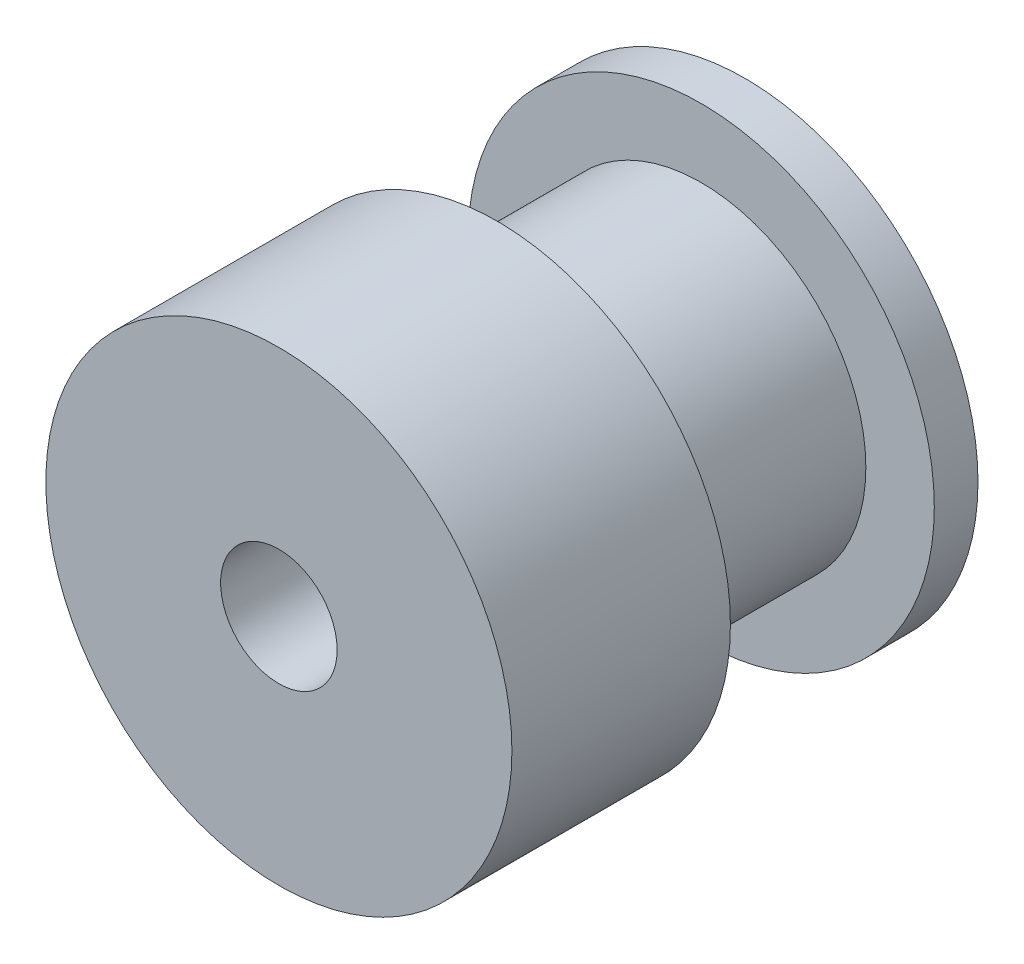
ISO-10303-21;
HEADER;
FILE_DESCRIPTION(('STEP AP214'),'2;1');
FILE_NAME('part.step','',(''),(''),'','','');
FILE_SCHEMA(('AUTOMOTIVE_DESIGN { 1 0 10303 214 1 1 1 1 }'));
ENDSEC;
DATA;
#1=APPLICATION_CONTEXT('core data for automotive mechanical design processes');
#2=APPLICATION_PROTOCOL_DEFINITION('international standard','automotive_design',2000,#1);
#3=PRODUCT_CONTEXT('',#1,'mechanical');
#4=PRODUCT('Part','Part','',(#3));
#5=PRODUCT_RELATED_PRODUCT_CATEGORY('part','',(#4));
#6=PRODUCT_DEFINITION_FORMATION('','',#4);
#7=PRODUCT_DEFINITION_CONTEXT('part definition',#1,'design');
#8=PRODUCT_DEFINITION('design','',#6,#7);
#9=PRODUCT_DEFINITION_SHAPE('','',#8);
#10=(LENGTH_UNIT() NAMED_UNIT(*) SI_UNIT(.MILLI.,.METRE.));
#11=(NAMED_UNIT(*) PLANE_ANGLE_UNIT() SI_UNIT($,.RADIAN.));
#12=(NAMED_UNIT(*) SI_UNIT($,.STERADIAN.) SOLID_ANGLE_UNIT());
#13=UNCERTAINTY_MEASURE_WITH_UNIT(LENGTH_MEASURE(1.E-05),#10,'distance_accuracy_value','');
#14=(GEOMETRIC_REPRESENTATION_CONTEXT(3) GLOBAL_UNCERTAINTY_ASSIGNED_CONTEXT((#13)) GLOBAL_UNIT_ASSIGNED_CONTEXT((#10,
#11,#12)) REPRESENTATION_CONTEXT('',''));
#15=CARTESIAN_POINT('',(0.,0.,0.));
#16=DIRECTION('',(0.,0.,1.));
#17=DIRECTION('',(1.,0.,0.));
#18=AXIS2_PLACEMENT_3D('',#15,#16,#17);
#19=CARTESIAN_POINT('',(0.,0.,1.5));
#20=DIRECTION('',(0.,0.,1.));
#21=DIRECTION('',(1.,0.,0.));
#22=AXIS2_PLACEMENT_3D('',#19,#20,#21);
#23=PLANE('',#22);
#24=CARTESIAN_POINT('',(0.,0.,1.5));
#25=DIRECTION('',(0.,0.,1.));
#26=DIRECTION('',(1.,0.,0.));
#27=AXIS2_PLACEMENT_3D('',#24,#25,#26);
#28=CIRCLE('',#27,5.65);
#29=CARTESIAN_POINT('',(5.65,0.,1.5));
#30=VERTEX_POINT('',#29);
#31=EDGE_CURVE('E10',#30,#30,#28,.T.);
#32=ORIENTED_EDGE('',*,*,#31,.F.);
#33=EDGE_LOOP('',(#32));
#34=FACE_BOUND('',#33,.T.);
#35=CARTESIAN_POINT('',(0.,0.,1.5));
#36=DIRECTION('',(0.,0.,1.));
#37=DIRECTION('',(1.,0.,0.));
#38=AXIS2_PLACEMENT_3D('',#35,#36,#37);
#39=CIRCLE('',#38,8.);
#40=CARTESIAN_POINT('',(8.,0.,1.5));
#41=VERTEX_POINT('',#40);
#42=EDGE_CURVE('E46',#41,#41,#39,.T.);
#43=ORIENTED_EDGE('',*,*,#42,.T.);
#44=EDGE_LOOP('',(#43));
#45=FACE_BOUND('',#44,.T.);
#46=ADVANCED_FACE('F37',(#34,#45),#23,.T.);
#47=CARTESIAN_POINT('',(0.,0.,0.));
#48=DIRECTION('',(0.,0.,1.));
#49=DIRECTION('',(1.,0.,0.));
#50=AXIS2_PLACEMENT_3D('',#47,#48,#49);
#51=PLANE('',#50);
#52=CARTESIAN_POINT('',(0.,0.,0.));
#53=DIRECTION('',(0.,0.,1.));
#54=DIRECTION('',(1.,0.,0.));
#55=AXIS2_PLACEMENT_3D('',#52,#53,#54);
#56=CIRCLE('',#55,8.);
#57=CARTESIAN_POINT('',(8.,0.,0.));
#58=VERTEX_POINT('',#57);
#59=EDGE_CURVE('E41',#58,#58,#56,.T.);
#60=ORIENTED_EDGE('',*,*,#59,.F.);
#61=EDGE_LOOP('',(#60));
#62=FACE_BOUND('',#61,.T.);
#63=CARTESIAN_POINT('',(0.,0.,0.));
#64=DIRECTION('',(0.,0.,1.));
#65=DIRECTION('',(1.,0.,0.));
#66=AXIS2_PLACEMENT_3D('',#63,#64,#65);
#67=CIRCLE('',#66,2.);
#68=CARTESIAN_POINT('',(2.,0.,0.));
#69=VERTEX_POINT('',#68);
#70=EDGE_CURVE('E56',#69,#69,#67,.T.);
#71=ORIENTED_EDGE('',*,*,#70,.T.);
#72=EDGE_LOOP('',(#71));
#73=FACE_BOUND('',#72,.T.);
#74=ADVANCED_FACE('F98',(#62,#73),#51,.F.);
#75=CARTESIAN_POINT('',(0.,0.,1.5));
#76=DIRECTION('',(0.,0.,-1.));
#77=DIRECTION('',(-1.,0.,0.));
#78=AXIS2_PLACEMENT_3D('',#75,#76,#77);
#79=CYLINDRICAL_SURFACE('',#78,8.);
#80=ORIENTED_EDGE('',*,*,#42,.F.);
#81=EDGE_LOOP('',(#80));
#82=FACE_BOUND('',#81,.T.);
#83=ORIENTED_EDGE('',*,*,#59,.T.);
#84=EDGE_LOOP('',(#83));
#85=FACE_BOUND('',#84,.T.);
#86=ADVANCED_FACE('F39',(#82,#85),#79,.T.);
#87=CARTESIAN_POINT('',(0.,0.,1.5));
#88=DIRECTION('',(0.,0.,-1.));
#89=DIRECTION('',(-1.,0.,0.));
#90=AXIS2_PLACEMENT_3D('',#87,#88,#89);
#91=CYLINDRICAL_SURFACE('',#90,2.);
#92=ORIENTED_EDGE('',*,*,#70,.F.);
#93=EDGE_LOOP('',(#92));
#94=FACE_BOUND('',#93,.T.);
#95=CARTESIAN_POINT('',(0.,0.,16.));
#96=DIRECTION('',(0.,0.,1.));
#97=DIRECTION('',(1.,0.,0.));
#98=AXIS2_PLACEMENT_3D('',#95,#96,#97);
#99=CIRCLE('',#98,2.);
#100=CARTESIAN_POINT('',(2.,0.,16.));
#101=VERTEX_POINT('',#100);
#102=EDGE_CURVE('E76',#101,#101,#99,.T.);
#103=ORIENTED_EDGE('',*,*,#102,.T.);
#104=EDGE_LOOP('',(#103));
#105=FACE_BOUND('',#104,.T.);
#106=ADVANCED_FACE('F82',(#94,#105),#91,.F.);
#107=CARTESIAN_POINT('',(0.,0.,8.5));
#108=DIRECTION('',(0.,0.,-1.));
#109=DIRECTION('',(-1.,0.,0.));
#110=AXIS2_PLACEMENT_3D('',#107,#108,#109);
#111=CYLINDRICAL_SURFACE('',#110,5.65);
#112=CARTESIAN_POINT('',(0.,0.,8.5));
#113=DIRECTION('',(0.,0.,1.));
#114=DIRECTION('',(1.,0.,0.));
#115=AXIS2_PLACEMENT_3D('',#112,#113,#114);
#116=CIRCLE('',#115,5.65);
#117=CARTESIAN_POINT('',(5.65,0.,8.5));
#118=VERTEX_POINT('',#117);
#119=EDGE_CURVE('E54',#118,#118,#116,.T.);
#120=ORIENTED_EDGE('',*,*,#119,.F.);
#121=EDGE_LOOP('',(#120));
#122=FACE_BOUND('',#121,.T.);
#123=ORIENTED_EDGE('',*,*,#31,.T.);
#124=EDGE_LOOP('',(#123));
#125=FACE_BOUND('',#124,.T.);
#126=ADVANCED_FACE('F87',(#122,#125),#111,.T.);
#127=CARTESIAN_POINT('',(0.,0.,16.));
#128=DIRECTION('',(0.,0.,1.));
#129=DIRECTION('',(1.,0.,0.));
#130=AXIS2_PLACEMENT_3D('',#127,#128,#129);
#131=PLANE('',#130);
#132=CARTESIAN_POINT('',(0.,0.,16.));
#133=DIRECTION('',(0.,0.,1.));
#134=DIRECTION('',(1.,0.,0.));
#135=AXIS2_PLACEMENT_3D('',#132,#133,#134);
#136=CIRCLE('',#135,8.);
#137=CARTESIAN_POINT('',(8.,0.,16.));
#138=VERTEX_POINT('',#137);
#139=EDGE_CURVE('E65',#138,#138,#136,.T.);
#140=ORIENTED_EDGE('',*,*,#139,.T.);
#141=EDGE_LOOP('',(#140));
#142=FACE_BOUND('',#141,.T.);
#143=ORIENTED_EDGE('',*,*,#102,.F.);
#144=EDGE_LOOP('',(#143));
#145=FACE_BOUND('',#144,.T.);
#146=ADVANCED_FACE('F84',(#142,#145),#131,.T.);
#147=CARTESIAN_POINT('',(0.,0.,8.5));
#148=DIRECTION('',(0.,0.,1.));
#149=DIRECTION('',(1.,0.,0.));
#150=AXIS2_PLACEMENT_3D('',#147,#148,#149);
#151=PLANE('',#150);
#152=ORIENTED_EDGE('',*,*,#119,.T.);
#153=EDGE_LOOP('',(#152));
#154=FACE_BOUND('',#153,.T.);
#155=CARTESIAN_POINT('',(0.,0.,8.5));
#156=DIRECTION('',(0.,0.,1.));
#157=DIRECTION('',(1.,0.,0.));
#158=AXIS2_PLACEMENT_3D('',#155,#156,#157);
#159=CIRCLE('',#158,8.);
#160=CARTESIAN_POINT('',(8.,0.,8.5));
#161=VERTEX_POINT('',#160);
#162=EDGE_CURVE('E70',#161,#161,#159,.T.);
#163=ORIENTED_EDGE('',*,*,#162,.F.);
#164=EDGE_LOOP('',(#163));
#165=FACE_BOUND('',#164,.T.);
#166=ADVANCED_FACE('F86',(#154,#165),#151,.F.);
#167=CARTESIAN_POINT('',(0.,0.,16.));
#168=DIRECTION('',(0.,0.,-1.));
#169=DIRECTION('',(-1.,0.,0.));
#170=AXIS2_PLACEMENT_3D('',#167,#168,#169);
#171=CYLINDRICAL_SURFACE('',#170,8.);
#172=ORIENTED_EDGE('',*,*,#139,.F.);
#173=EDGE_LOOP('',(#172));
#174=FACE_BOUND('',#173,.T.);
#175=ORIENTED_EDGE('',*,*,#162,.T.);
#176=EDGE_LOOP('',(#175));
#177=FACE_BOUND('',#176,.T.);
#178=ADVANCED_FACE('F93',(#174,#177),#171,.T.);
#179=CLOSED_SHELL('',(#46,#74,#86,#106,#126,#146,#166,#178));
#180=MANIFOLD_SOLID_BREP('B2',#179);
#181=ADVANCED_BREP_SHAPE_REPRESENTATION('',(#18,#180),#14);
#182=SHAPE_DEFINITION_REPRESENTATION(#9,#181);
ENDSEC;
END-ISO-10303-21;
